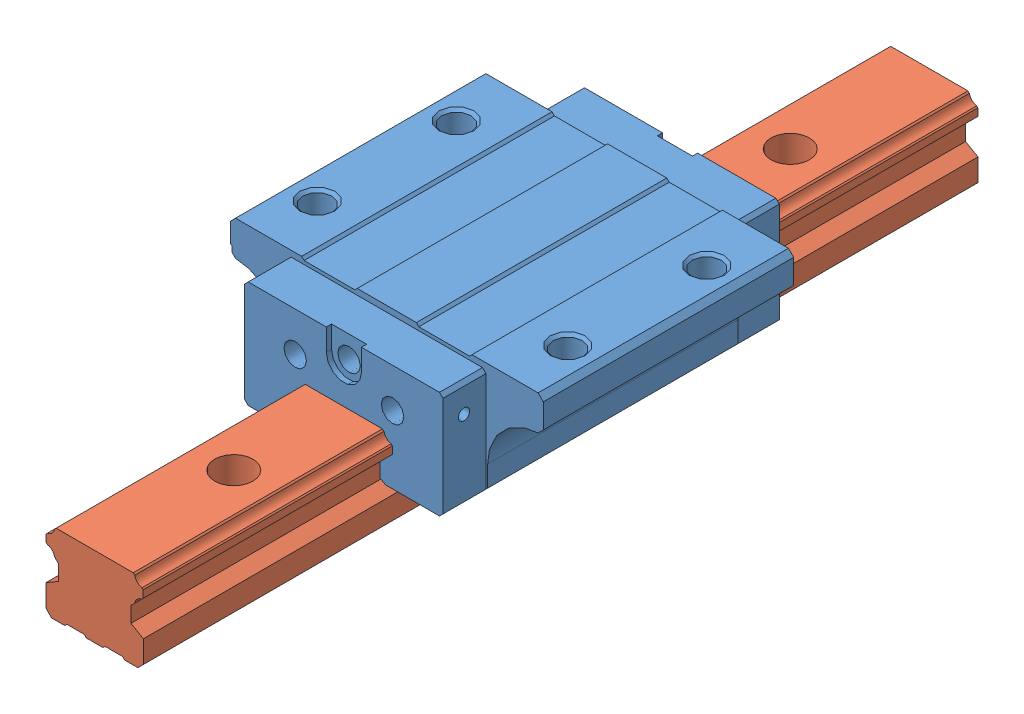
SolidWorks assembly ELW30CC1R240 E=40.sldasm, configuration Default (file format 13000). Lengths in mm.
Overall size (90 42.01 240).
2 component instances, 2 part files, 0 mates.
Components (placement in the parent):
- ELW30CC-1: ELW30CC.SLDPRT [Default] at (0 42 -71.65) size (90 32.5 96.7)
- ELR30R240 E=40-1: ELR30R240 E=40.SLDPRT [Default] at (0 42 0) size (28 23.01 240)
